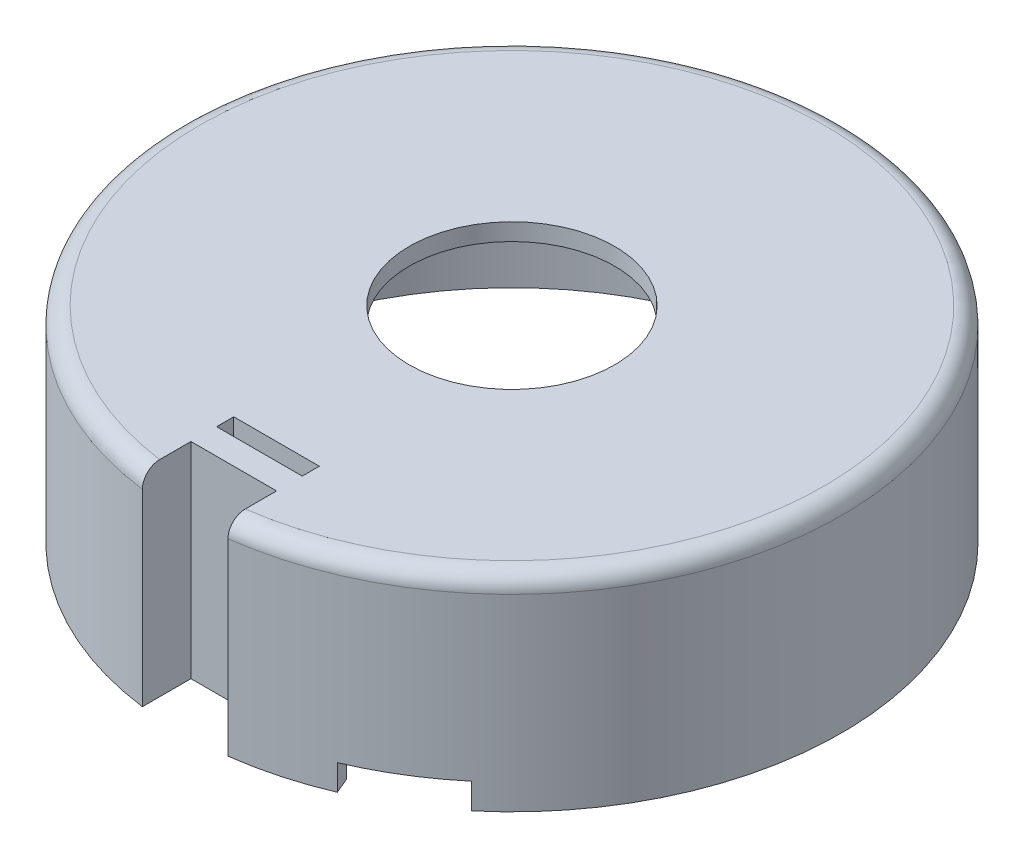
from build123d import *

# Parameters (mm, degrees)
EXTRUSION1_DEPTH        = 11
ESQUISSE2_R             = 6
ESQUISSE2_W             = 5
ESQUISSE2_H             = 1
EXTRUSION2_DEPTH        = 1
CONG_1_R                = 1
EXTRUSION4_REACH        = 33.751
EXTRUSION4_START        = 2
ESQUISSE3_R             = 2
ESQUISSE3_R_2           = 1
ESQUISSE3_R_3           = 2.000000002
ESQUISSE3_R_4           = 1.000000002
ENL_V_MAT_EXTRU_1_DEPTH = 1.5


with BuildPart() as part:
    # Esquisse1 → Extrusion1 (new body)
    with BuildSketch(Plane(origin=(0, 0, 0), x_dir=(1, 0, 0), z_dir=(0, 1, 0))):
        with BuildLine():
            Line((-2.5, -19.086971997), (-2.5, -16.25))
            Line((-2.5, -16.25), (2.5, -16.25))
            Line((2.5, -16.25), (2.5, -19.086971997))
            ThreePointArc((2.5, -19.086971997), (0, 19.25), (-2.5, -19.086971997))
        make_face()
        with BuildLine():
            Line((3.5, -17.911239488), (3.5, -15.25))
            Line((3.5, -15.25), (-3.5, -15.25))
            Line((-3.5, -15.25), (-3.5, -17.911239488))
            ThreePointArc((-3.5, -17.911239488), (0, 18.25), (3.5, -17.911239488))
        make_face(mode=Mode.SUBTRACT)
    extrude(amount=EXTRUSION1_DEPTH)

    # Esquisse2 → Extrusion2 (add)
    with BuildSketch(Plane(origin=(15.455379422, 11, -10.50428736), x_dir=(-1, 0, 0), z_dir=(0, 1, 0))):
        with BuildLine():
            Line((17.955379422, 29.591259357), (17.955379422, 26.75428736))
            Line((17.955379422, 26.75428736), (12.955379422, 26.75428736))
            Line((12.955379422, 26.75428736), (12.955379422, 29.591259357))
            ThreePointArc((12.955379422, 29.591259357), (15.455379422, -8.74571264), (17.955379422, 29.591259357))
        make_face()
        with Locations(Location((15.455379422, 10.50428736, 0), (0, 0, 90))):
            Circle(ESQUISSE2_R, mode=Mode.SUBTRACT)
        with Locations((15.455379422, 24.75428736)):
            Rectangle(ESQUISSE2_W, ESQUISSE2_H, mode=Mode.SUBTRACT)
    extrude(amount=EXTRUSION2_DEPTH)

    # Cong_1
    cong_1_edges = [part.edges().sort_by_distance(p)[0] for p in [
        (0, 12, -19.25),
    ]]
    fillet(cong_1_edges, radius=CONG_1_R)

    # Esquisse3 → Extrusion4 (add, up to next)
    with BuildSketch(Plane(origin=(0, 0, 0), x_dir=(1, 0, 0), z_dir=(0, 1, 0)).offset(EXTRUSION4_START), mode=Mode.PRIVATE) as extrusion4_sk1:
        with Locations((0, 17)):
            Circle(ESQUISSE3_R)
        with Locations(Location((0, 17, 0), (0, 0, 90))):
            Circle(ESQUISSE3_R_2, mode=Mode.SUBTRACT)
    extrusion4_tool1 = extrude(extrusion4_sk1.sketch, amount=EXTRUSION4_REACH, mode=Mode.PRIVATE) - part.part
    # Esquisse3 → Extrusion4 (add, up to next)
    with BuildSketch(Plane(origin=(0, 0, 0), x_dir=(1, 0, 0), z_dir=(0, 1, 0)).offset(EXTRUSION4_START), mode=Mode.PRIVATE) as extrusion4_sk2:
        with Locations((14.72243186, -8.5)):
            Circle(ESQUISSE3_R_3)
        with Locations(Location((14.72243186, -8.5, 0), (0, 0, 90))):
            Circle(ESQUISSE3_R_4, mode=Mode.SUBTRACT)
    extrusion4_tool2 = extrude(extrusion4_sk2.sketch, amount=EXTRUSION4_REACH, mode=Mode.PRIVATE) - part.part
    # Esquisse3 → Extrusion4 (add, up to next)
    with BuildSketch(Plane(origin=(0, 0, 0), x_dir=(1, 0, 0), z_dir=(0, 1, 0)).offset(EXTRUSION4_START), mode=Mode.PRIVATE) as extrusion4_sk3:
        with Locations((-14.722431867, -8.499999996)):
            Circle(ESQUISSE3_R)
        with Locations(Location((-14.722431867, -8.499999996, 0), (0, 0, 90))):
            Circle(ESQUISSE3_R_2, mode=Mode.SUBTRACT)
    extrusion4_tool3 = extrude(extrusion4_sk3.sketch, amount=EXTRUSION4_REACH, mode=Mode.PRIVATE) - part.part
    add(extrusion4_tool1.solids().sort_by_distance((-1.943431, 2, -17))[0])
    add(extrusion4_tool2.solids().sort_by_distance((12.779, 2, 8.5))[0])
    add(extrusion4_tool3.solids().sort_by_distance((-16.665863, 2, 8.5))[0])

    # Esquisse4 → Enl_v. mat.-Extru.1 (cut)
    with BuildSketch(Plane.XZ):
        with BuildLine():
            Line((11.730873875, 13.980311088), (12.373661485, 14.746355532))
            ThreePointArc((12.373661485, 14.746355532), (10.058097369, 16.413323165), (7.521574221, 17.71971843))
            Line((7.521574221, 17.71971843), (7.130843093, 16.799213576))
            ThreePointArc((7.130843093, 16.799213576), (9.535598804, 15.560683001), (11.730873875, 13.980311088))
        make_face()
        with BuildLine():
            Line((6.241867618, -17.149390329), (6.583887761, -18.089082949))
            ThreePointArc((6.583887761, -18.089082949), (9.185306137, -16.917229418), (11.584939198, -15.373733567))
            Line((11.584939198, -15.373733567), (10.983124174, -14.575098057))
            ThreePointArc((10.983124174, -14.575098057), (8.708147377, -16.038412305), (6.241867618, -17.149390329))
        make_face()
        with BuildLine():
            Line((-17.972741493, 3.16907924), (-18.957549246, 3.342727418))
            ThreePointArc((-18.957549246, 3.342727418), (-19.243403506, 0.503906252), (-19.106513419, -2.345984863))
            Line((-19.106513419, -2.345984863), (-18.113967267, -2.224115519))
            ThreePointArc((-18.113967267, -2.224115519), (-18.243746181, 0.477729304), (-17.972741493, 3.16907924))
        make_face()
    extrude(amount=-ENL_V_MAT_EXTRU_1_DEPTH, mode=Mode.SUBTRACT)


solid = part.part
